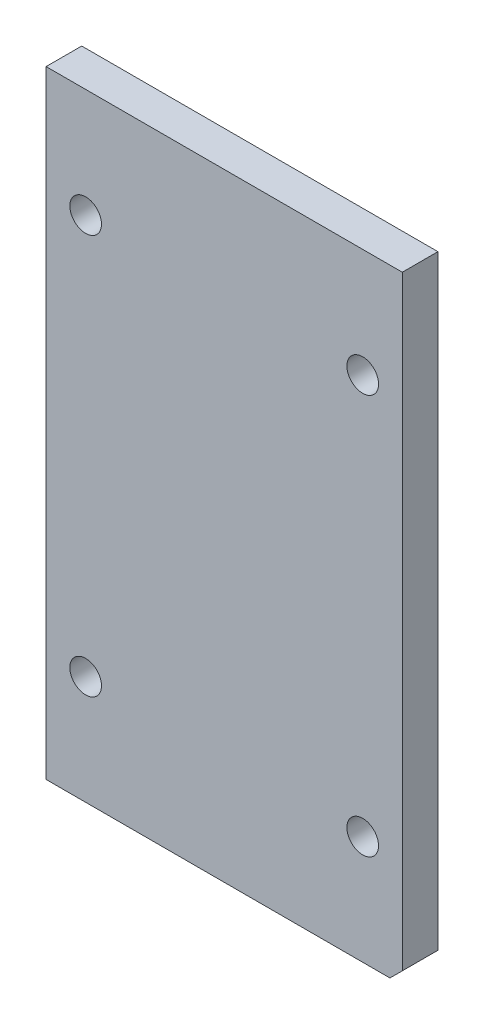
from build123d import *

# Parameters (mm, degrees)
SKETCH1_W                = 90
SKETCH1_H                = 156
BOSS_EXTRUDE1_DEPTH      = 9
TAPPED_HOLE1_D           = 6.8
TAPPED_HOLE1_DEPTH       = 11.857073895
TAPPED_HOLE1_CBORE_D     = 8
TAPPED_HOLE1_CBORE_DEPTH = 8.9
TAPPED_HOLE1_TIP         = 2.042926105
CHAMFER1_SIZE            = 3.12


with BuildPart() as part:
    # Sketch1 → Boss-Extrude1 (new body)
    with BuildSketch(Plane.XY):
        Rectangle(SKETCH1_W, SKETCH1_H)
    extrude(amount=-BOSS_EXTRUDE1_DEPTH)

    # Tapped Hole1
    with Locations(Plane(origin=(-522.991452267, 0, 0), x_dir=(1, 0, 0), z_dir=(0, 0, 1))):
        with Locations((557.991452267, 50.5), (557.991452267, -50.5), (487.991452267, -50.5), (487.991452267, 50.5)):
            CounterBoreHole(TAPPED_HOLE1_D / 2, TAPPED_HOLE1_CBORE_D / 2, TAPPED_HOLE1_CBORE_DEPTH, depth=TAPPED_HOLE1_DEPTH)
            with Locations((0, 0, -(TAPPED_HOLE1_DEPTH + TAPPED_HOLE1_TIP / 2))):  # 118° drill point
                Cone(0, TAPPED_HOLE1_D / 2, TAPPED_HOLE1_TIP, mode=Mode.SUBTRACT)

    # Chamfer1
    chamfer1_edges = [part.edges().sort_by_distance(p)[0] for p in [
        (45, -78, -4.5),
    ]]
    chamfer(chamfer1_edges, length=CHAMFER1_SIZE)


solid = part.part
